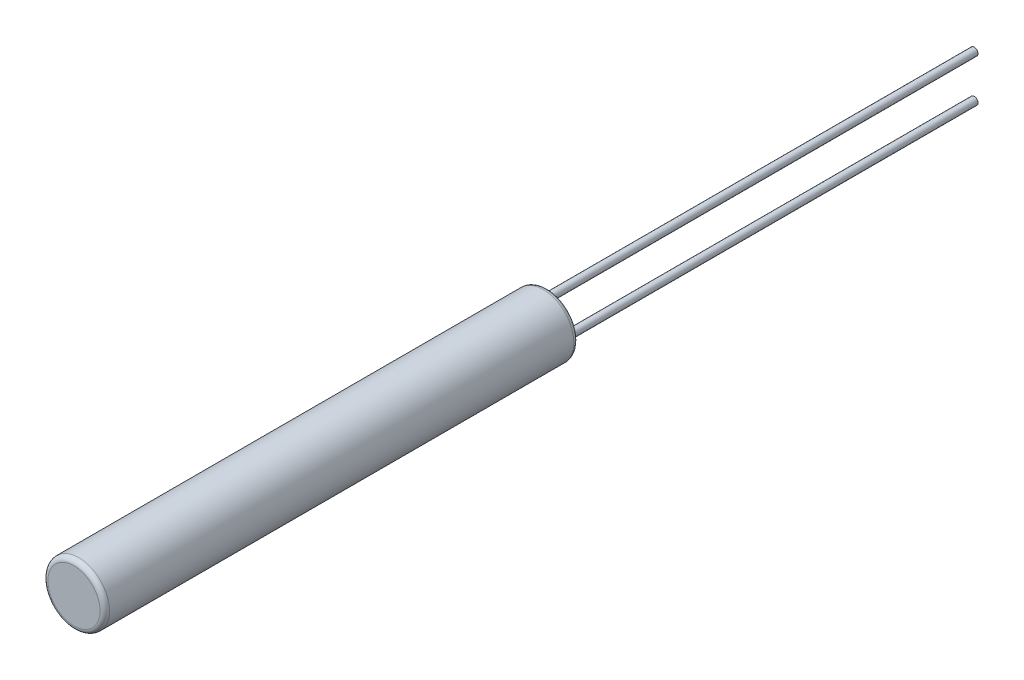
ISO-10303-21;
HEADER;
FILE_DESCRIPTION(('STEP AP214'),'2;1');
FILE_NAME('part.step','',(''),(''),'','','');
FILE_SCHEMA(('AUTOMOTIVE_DESIGN { 1 0 10303 214 1 1 1 1 }'));
ENDSEC;
DATA;
#1=APPLICATION_CONTEXT('core data for automotive mechanical design processes');
#2=APPLICATION_PROTOCOL_DEFINITION('international standard','automotive_design',2000,#1);
#3=PRODUCT_CONTEXT('',#1,'mechanical');
#4=PRODUCT('Part','Part','',(#3));
#5=PRODUCT_RELATED_PRODUCT_CATEGORY('part','',(#4));
#6=PRODUCT_DEFINITION_FORMATION('','',#4);
#7=PRODUCT_DEFINITION_CONTEXT('part definition',#1,'design');
#8=PRODUCT_DEFINITION('design','',#6,#7);
#9=PRODUCT_DEFINITION_SHAPE('','',#8);
#10=(LENGTH_UNIT() NAMED_UNIT(*) SI_UNIT(.MILLI.,.METRE.));
#11=(NAMED_UNIT(*) PLANE_ANGLE_UNIT() SI_UNIT($,.RADIAN.));
#12=(NAMED_UNIT(*) SI_UNIT($,.STERADIAN.) SOLID_ANGLE_UNIT());
#13=UNCERTAINTY_MEASURE_WITH_UNIT(LENGTH_MEASURE(1.E-05),#10,'distance_accuracy_value','');
#14=(GEOMETRIC_REPRESENTATION_CONTEXT(3) GLOBAL_UNCERTAINTY_ASSIGNED_CONTEXT((#13)) GLOBAL_UNIT_ASSIGNED_CONTEXT((#10,
#11,#12)) REPRESENTATION_CONTEXT('',''));
#15=CARTESIAN_POINT('',(0.,0.,0.));
#16=DIRECTION('',(0.,0.,1.));
#17=DIRECTION('',(1.,0.,0.));
#18=AXIS2_PLACEMENT_3D('',#15,#16,#17);
#19=CARTESIAN_POINT('',(0.,0.,10.));
#20=DIRECTION('',(0.,0.,-1.));
#21=DIRECTION('',(-1.,0.,0.));
#22=AXIS2_PLACEMENT_3D('',#19,#20,#21);
#23=CYLINDRICAL_SURFACE('',#22,0.65);
#24=CARTESIAN_POINT('',(0.,0.,9.9));
#25=DIRECTION('',(0.,0.,1.));
#26=DIRECTION('',(1.,0.,0.));
#27=AXIS2_PLACEMENT_3D('',#24,#25,#26);
#28=CIRCLE('',#27,0.65);
#29=CARTESIAN_POINT('',(0.65,0.,9.9));
#30=VERTEX_POINT('',#29);
#31=EDGE_CURVE('E53',#30,#30,#28,.F.);
#32=ORIENTED_EDGE('',*,*,#31,.T.);
#33=EDGE_LOOP('',(#32));
#34=FACE_BOUND('',#33,.T.);
#35=CARTESIAN_POINT('',(0.,0.,0.0999999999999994));
#36=DIRECTION('',(0.,0.,1.));
#37=DIRECTION('',(1.,0.,0.));
#38=AXIS2_PLACEMENT_3D('',#35,#36,#37);
#39=CIRCLE('',#38,0.65);
#40=CARTESIAN_POINT('',(0.65,0.,0.0999999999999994));
#41=VERTEX_POINT('',#40);
#42=EDGE_CURVE('E57',#41,#41,#39,.T.);
#43=ORIENTED_EDGE('',*,*,#42,.T.);
#44=EDGE_LOOP('',(#43));
#45=FACE_BOUND('',#44,.T.);
#46=ADVANCED_FACE('F46',(#34,#45),#23,.T.);
#47=CARTESIAN_POINT('',(0.,0.,10.));
#48=DIRECTION('',(0.,0.,1.));
#49=DIRECTION('',(1.,0.,0.));
#50=AXIS2_PLACEMENT_3D('',#47,#48,#49);
#51=PLANE('',#50);
#52=CARTESIAN_POINT('',(0.,0.,10.));
#53=DIRECTION('',(0.,0.,1.));
#54=DIRECTION('',(1.,0.,0.));
#55=AXIS2_PLACEMENT_3D('',#52,#53,#54);
#56=CIRCLE('',#55,0.55);
#57=CARTESIAN_POINT('',(0.55,0.,10.));
#58=VERTEX_POINT('',#57);
#59=EDGE_CURVE('E61',#58,#58,#56,.T.);
#60=ORIENTED_EDGE('',*,*,#59,.T.);
#61=EDGE_LOOP('',(#60));
#62=FACE_BOUND('',#61,.T.);
#63=ADVANCED_FACE('F92',(#62),#51,.T.);
#64=CARTESIAN_POINT('',(0.,0.,0.));
#65=DIRECTION('',(0.,0.,1.));
#66=DIRECTION('',(1.,0.,0.));
#67=AXIS2_PLACEMENT_3D('',#64,#65,#66);
#68=PLANE('',#67);
#69=CARTESIAN_POINT('',(0.,0.,0.));
#70=DIRECTION('',(0.,0.,1.));
#71=DIRECTION('',(1.,0.,0.));
#72=AXIS2_PLACEMENT_3D('',#69,#70,#71);
#73=CIRCLE('',#72,0.55);
#74=CARTESIAN_POINT('',(0.55,0.,0.));
#75=VERTEX_POINT('',#74);
#76=EDGE_CURVE('E12',#75,#75,#73,.F.);
#77=ORIENTED_EDGE('',*,*,#76,.T.);
#78=EDGE_LOOP('',(#77));
#79=FACE_BOUND('',#78,.T.);
#80=CARTESIAN_POINT('',(0.,0.45,0.));
#81=DIRECTION('',(0.,0.,1.));
#82=DIRECTION('',(1.,0.,0.));
#83=AXIS2_PLACEMENT_3D('',#80,#81,#82);
#84=CIRCLE('',#83,0.08);
#85=CARTESIAN_POINT('',(0.08,0.45,0.));
#86=VERTEX_POINT('',#85);
#87=EDGE_CURVE('E66',#86,#86,#84,.F.);
#88=ORIENTED_EDGE('',*,*,#87,.F.);
#89=EDGE_LOOP('',(#88));
#90=FACE_BOUND('',#89,.T.);
#91=CARTESIAN_POINT('',(0.,-0.45,0.));
#92=DIRECTION('',(0.,0.,1.));
#93=DIRECTION('',(1.,0.,0.));
#94=AXIS2_PLACEMENT_3D('',#91,#92,#93);
#95=CIRCLE('',#94,0.08);
#96=CARTESIAN_POINT('',(0.08,-0.45,0.));
#97=VERTEX_POINT('',#96);
#98=EDGE_CURVE('E69',#97,#97,#95,.F.);
#99=ORIENTED_EDGE('',*,*,#98,.F.);
#100=EDGE_LOOP('',(#99));
#101=FACE_BOUND('',#100,.T.);
#102=ADVANCED_FACE('F88',(#79,#90,#101),#68,.F.);
#103=CARTESIAN_POINT('',(0.,-0.45,-9.));
#104=DIRECTION('',(0.,0.,1.));
#105=DIRECTION('',(1.,0.,0.));
#106=AXIS2_PLACEMENT_3D('',#103,#104,#105);
#107=CYLINDRICAL_SURFACE('',#106,0.08);
#108=CARTESIAN_POINT('',(0.,-0.45,-9.));
#109=DIRECTION('',(0.,0.,-1.));
#110=DIRECTION('',(-1.,0.,0.));
#111=AXIS2_PLACEMENT_3D('',#108,#109,#110);
#112=CIRCLE('',#111,0.08);
#113=CARTESIAN_POINT('',(-0.08,-0.45,-9.));
#114=VERTEX_POINT('',#113);
#115=EDGE_CURVE('E72',#114,#114,#112,.T.);
#116=ORIENTED_EDGE('',*,*,#115,.F.);
#117=EDGE_LOOP('',(#116));
#118=FACE_BOUND('',#117,.T.);
#119=ORIENTED_EDGE('',*,*,#98,.T.);
#120=EDGE_LOOP('',(#119));
#121=FACE_BOUND('',#120,.T.);
#122=ADVANCED_FACE('F91',(#118,#121),#107,.T.);
#123=CARTESIAN_POINT('',(0.,-0.45,-9.));
#124=DIRECTION('',(0.,0.,-1.));
#125=DIRECTION('',(-1.,0.,0.));
#126=AXIS2_PLACEMENT_3D('',#123,#124,#125);
#127=PLANE('',#126);
#128=ORIENTED_EDGE('',*,*,#115,.T.);
#129=EDGE_LOOP('',(#128));
#130=FACE_BOUND('',#129,.T.);
#131=ADVANCED_FACE('F84',(#130),#127,.T.);
#132=CARTESIAN_POINT('',(0.,0.45,-9.));
#133=DIRECTION('',(0.,0.,1.));
#134=DIRECTION('',(1.,0.,0.));
#135=AXIS2_PLACEMENT_3D('',#132,#133,#134);
#136=CYLINDRICAL_SURFACE('',#135,0.08);
#137=CARTESIAN_POINT('',(0.,0.45,-9.));
#138=DIRECTION('',(0.,0.,-1.));
#139=DIRECTION('',(-1.,0.,0.));
#140=AXIS2_PLACEMENT_3D('',#137,#138,#139);
#141=CIRCLE('',#140,0.08);
#142=CARTESIAN_POINT('',(-0.08,0.45,-9.));
#143=VERTEX_POINT('',#142);
#144=EDGE_CURVE('E75',#143,#143,#141,.T.);
#145=ORIENTED_EDGE('',*,*,#144,.F.);
#146=EDGE_LOOP('',(#145));
#147=FACE_BOUND('',#146,.T.);
#148=ORIENTED_EDGE('',*,*,#87,.T.);
#149=EDGE_LOOP('',(#148));
#150=FACE_BOUND('',#149,.T.);
#151=ADVANCED_FACE('F81',(#147,#150),#136,.T.);
#152=CARTESIAN_POINT('',(0.,0.45,-9.));
#153=DIRECTION('',(0.,0.,-1.));
#154=DIRECTION('',(-1.,0.,0.));
#155=AXIS2_PLACEMENT_3D('',#152,#153,#154);
#156=PLANE('',#155);
#157=ORIENTED_EDGE('',*,*,#144,.T.);
#158=EDGE_LOOP('',(#157));
#159=FACE_BOUND('',#158,.T.);
#160=ADVANCED_FACE('F79',(#159),#156,.T.);
#161=CARTESIAN_POINT('',(0.,0.,9.9));
#162=DIRECTION('',(0.,0.,1.));
#163=DIRECTION('',(1.,0.,0.));
#164=AXIS2_PLACEMENT_3D('',#161,#162,#163);
#165=TOROIDAL_SURFACE('',#164,0.55,0.1);
#166=ORIENTED_EDGE('',*,*,#31,.F.);
#167=EDGE_LOOP('',(#166));
#168=FACE_BOUND('',#167,.T.);
#169=ORIENTED_EDGE('',*,*,#59,.F.);
#170=EDGE_LOOP('',(#169));
#171=FACE_BOUND('',#170,.T.);
#172=ADVANCED_FACE('F113',(#168,#171),#165,.T.);
#173=CARTESIAN_POINT('',(0.,0.,0.0999999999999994));
#174=DIRECTION('',(0.,0.,1.));
#175=DIRECTION('',(1.,0.,0.));
#176=AXIS2_PLACEMENT_3D('',#173,#174,#175);
#177=TOROIDAL_SURFACE('',#176,0.55,0.1);
#178=ORIENTED_EDGE('',*,*,#76,.F.);
#179=EDGE_LOOP('',(#178));
#180=FACE_BOUND('',#179,.T.);
#181=ORIENTED_EDGE('',*,*,#42,.F.);
#182=EDGE_LOOP('',(#181));
#183=FACE_BOUND('',#182,.T.);
#184=ADVANCED_FACE('F48',(#180,#183),#177,.T.);
#185=CLOSED_SHELL('',(#46,#63,#102,#122,#131,#151,#160,#172,#184));
#186=MANIFOLD_SOLID_BREP('B2',#185);
#187=ADVANCED_BREP_SHAPE_REPRESENTATION('',(#18,#186),#14);
#188=SHAPE_DEFINITION_REPRESENTATION(#9,#187);
ENDSEC;
END-ISO-10303-21;
